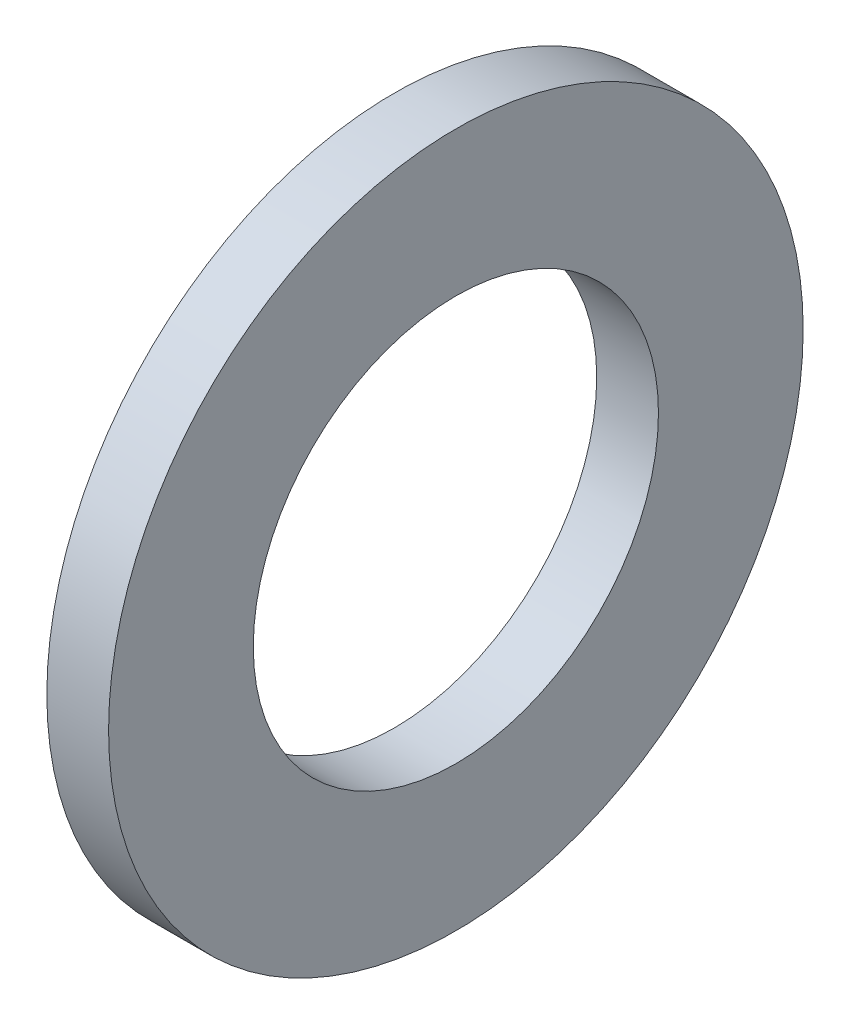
from build123d import *

# Parameters (mm, degrees)
SKETCH1_W = 1.6
SKETCH1_H = 3.75


with BuildPart() as part:
    # Sketch1 → Base-Revolve (revolve)
    with BuildSketch(Plane.XY, mode=Mode.PRIVATE) as base_revolve_sk:
        with Locations((-0.8, 7.125)):
            Rectangle(SKETCH1_W, SKETCH1_H)
    revolve(base_revolve_sk.sketch.rotate(Axis((-34.925, 0, 0), (1, 0, 0)), 90), axis=Axis((-34.925, 0, 0), (1, 0, 0)))


solid = part.part
